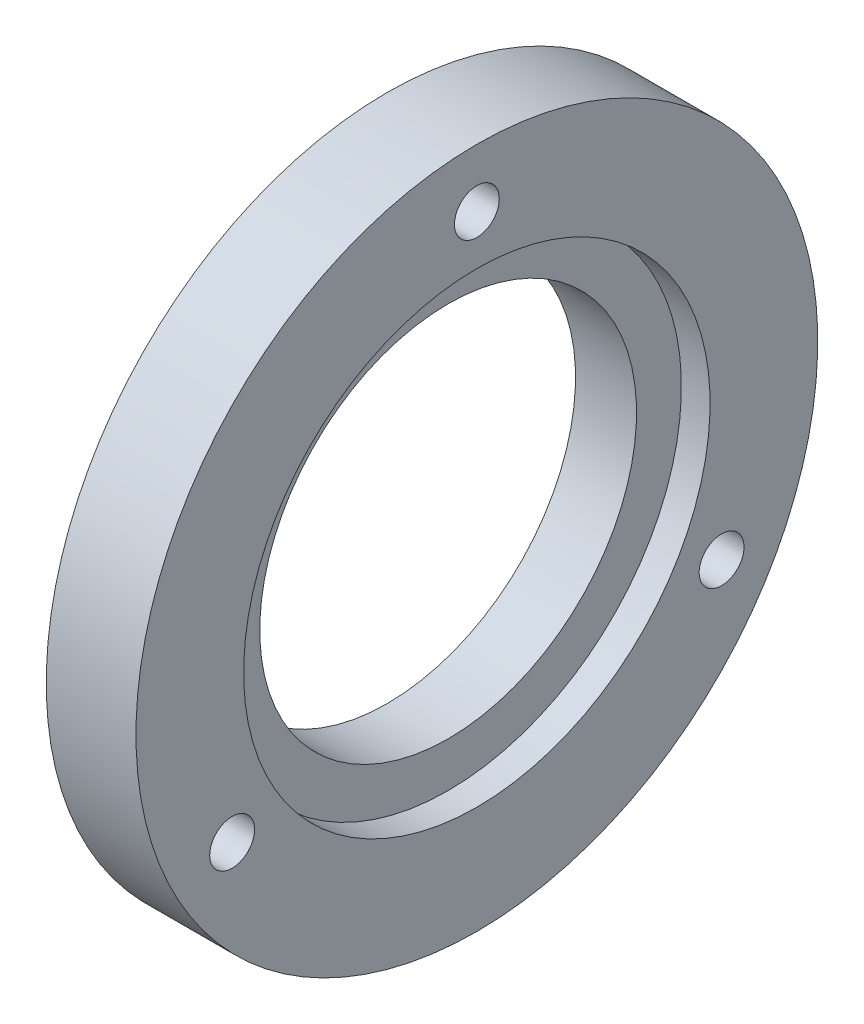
ISO-10303-21;
HEADER;
FILE_DESCRIPTION(('STEP AP214'),'2;1');
FILE_NAME('part.step','',(''),(''),'','','');
FILE_SCHEMA(('AUTOMOTIVE_DESIGN { 1 0 10303 214 1 1 1 1 }'));
ENDSEC;
DATA;
#1=APPLICATION_CONTEXT('core data for automotive mechanical design processes');
#2=APPLICATION_PROTOCOL_DEFINITION('international standard','automotive_design',2000,#1);
#3=PRODUCT_CONTEXT('',#1,'mechanical');
#4=PRODUCT('Part','Part','',(#3));
#5=PRODUCT_RELATED_PRODUCT_CATEGORY('part','',(#4));
#6=PRODUCT_DEFINITION_FORMATION('','',#4);
#7=PRODUCT_DEFINITION_CONTEXT('part definition',#1,'design');
#8=PRODUCT_DEFINITION('design','',#6,#7);
#9=PRODUCT_DEFINITION_SHAPE('','',#8);
#10=(LENGTH_UNIT() NAMED_UNIT(*) SI_UNIT(.MILLI.,.METRE.));
#11=(NAMED_UNIT(*) PLANE_ANGLE_UNIT() SI_UNIT($,.RADIAN.));
#12=(NAMED_UNIT(*) SI_UNIT($,.STERADIAN.) SOLID_ANGLE_UNIT());
#13=UNCERTAINTY_MEASURE_WITH_UNIT(LENGTH_MEASURE(1.E-05),#10,'distance_accuracy_value','');
#14=(GEOMETRIC_REPRESENTATION_CONTEXT(3) GLOBAL_UNCERTAINTY_ASSIGNED_CONTEXT((#13)) GLOBAL_UNIT_ASSIGNED_CONTEXT((#10,
#11,#12)) REPRESENTATION_CONTEXT('',''));
#15=CARTESIAN_POINT('',(0.,0.,0.));
#16=DIRECTION('',(0.,0.,1.));
#17=DIRECTION('',(1.,0.,0.));
#18=AXIS2_PLACEMENT_3D('',#15,#16,#17);
#19=CARTESIAN_POINT('',(3.39999999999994,0.,0.));
#20=DIRECTION('',(1.,0.,0.));
#21=DIRECTION('',(0.,1.,0.));
#22=AXIS2_PLACEMENT_3D('',#19,#20,#21);
#23=CYLINDRICAL_SURFACE('',#22,13.);
#24=CARTESIAN_POINT('',(5.,0.,0.));
#25=DIRECTION('',(1.,0.,0.));
#26=DIRECTION('',(0.,1.,0.));
#27=AXIS2_PLACEMENT_3D('',#24,#25,#26);
#28=CIRCLE('',#27,13.);
#29=CARTESIAN_POINT('',(5.00000000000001,13.,0.));
#30=VERTEX_POINT('',#29);
#31=EDGE_CURVE('E18',#30,#30,#28,.F.);
#32=ORIENTED_EDGE('',*,*,#31,.F.);
#33=EDGE_LOOP('',(#32));
#34=FACE_BOUND('',#33,.T.);
#35=CARTESIAN_POINT('',(3.39999999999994,0.,0.));
#36=DIRECTION('',(1.,0.,0.));
#37=DIRECTION('',(0.,1.,0.));
#38=AXIS2_PLACEMENT_3D('',#35,#36,#37);
#39=CIRCLE('',#38,13.);
#40=CARTESIAN_POINT('',(3.39999999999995,13.,0.));
#41=VERTEX_POINT('',#40);
#42=EDGE_CURVE('E52',#41,#41,#39,.T.);
#43=ORIENTED_EDGE('',*,*,#42,.F.);
#44=EDGE_LOOP('',(#43));
#45=FACE_BOUND('',#44,.T.);
#46=ADVANCED_FACE('F15',(#34,#45),#23,.F.);
#47=CARTESIAN_POINT('',(5.,0.,-1.31838984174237E-13));
#48=DIRECTION('',(1.,0.,0.));
#49=DIRECTION('',(0.,1.,0.));
#50=AXIS2_PLACEMENT_3D('',#47,#48,#49);
#51=PLANE('',#50);
#52=CARTESIAN_POINT('',(5.,0.,-1.31838984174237E-13));
#53=DIRECTION('',(-1.,0.,0.));
#54=DIRECTION('',(0.,-1.,0.));
#55=AXIS2_PLACEMENT_3D('',#52,#53,#54);
#56=CIRCLE('',#55,19.);
#57=CARTESIAN_POINT('',(5.,-19.,-1.31838984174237E-13));
#58=VERTEX_POINT('',#57);
#59=EDGE_CURVE('E41',#58,#58,#56,.T.);
#60=ORIENTED_EDGE('',*,*,#59,.F.);
#61=EDGE_LOOP('',(#60));
#62=FACE_BOUND('',#61,.T.);
#63=ORIENTED_EDGE('',*,*,#31,.T.);
#64=EDGE_LOOP('',(#63));
#65=FACE_BOUND('',#64,.T.);
#66=CARTESIAN_POINT('',(4.99999999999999,15.75,0.));
#67=DIRECTION('',(1.,0.,0.));
#68=DIRECTION('',(0.,1.,0.));
#69=AXIS2_PLACEMENT_3D('',#66,#67,#68);
#70=CIRCLE('',#69,1.24999999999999);
#71=CARTESIAN_POINT('',(4.99999999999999,17.,0.));
#72=VERTEX_POINT('',#71);
#73=EDGE_CURVE('E44',#72,#72,#70,.F.);
#74=ORIENTED_EDGE('',*,*,#73,.T.);
#75=EDGE_LOOP('',(#74));
#76=FACE_BOUND('',#75,.T.);
#77=CARTESIAN_POINT('',(4.99999999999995,-7.87499999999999,-13.6399001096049));
#78=DIRECTION('',(1.,0.,0.));
#79=DIRECTION('',(0.,1.,0.));
#80=AXIS2_PLACEMENT_3D('',#77,#78,#79);
#81=CIRCLE('',#80,1.24999999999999);
#82=CARTESIAN_POINT('',(4.99999999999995,-6.625,-13.6399001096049));
#83=VERTEX_POINT('',#82);
#84=EDGE_CURVE('E47',#83,#83,#81,.F.);
#85=ORIENTED_EDGE('',*,*,#84,.T.);
#86=EDGE_LOOP('',(#85));
#87=FACE_BOUND('',#86,.T.);
#88=CARTESIAN_POINT('',(5.00000000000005,-7.87499999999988,13.639900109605));
#89=DIRECTION('',(1.,0.,0.));
#90=DIRECTION('',(0.,1.,0.));
#91=AXIS2_PLACEMENT_3D('',#88,#89,#90);
#92=CIRCLE('',#91,1.24999999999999);
#93=CARTESIAN_POINT('',(5.00000000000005,-6.62499999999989,13.639900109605));
#94=VERTEX_POINT('',#93);
#95=EDGE_CURVE('E50',#94,#94,#92,.F.);
#96=ORIENTED_EDGE('',*,*,#95,.T.);
#97=EDGE_LOOP('',(#96));
#98=FACE_BOUND('',#97,.T.);
#99=ADVANCED_FACE('F59',(#62,#65,#76,#87,#98),#51,.T.);
#100=CARTESIAN_POINT('',(3.39999999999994,0.,0.));
#101=DIRECTION('',(1.,0.,0.));
#102=DIRECTION('',(0.,1.,0.));
#103=AXIS2_PLACEMENT_3D('',#100,#101,#102);
#104=PLANE('',#103);
#105=ORIENTED_EDGE('',*,*,#42,.T.);
#106=EDGE_LOOP('',(#105));
#107=FACE_BOUND('',#106,.T.);
#108=CARTESIAN_POINT('',(3.39999999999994,0.,-1.31874867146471E-13));
#109=DIRECTION('',(-1.,0.,0.));
#110=DIRECTION('',(0.,-1.,0.));
#111=AXIS2_PLACEMENT_3D('',#108,#109,#110);
#112=CIRCLE('',#111,10.5);
#113=CARTESIAN_POINT('',(3.39999999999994,-10.5,-1.31874867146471E-13));
#114=VERTEX_POINT('',#113);
#115=EDGE_CURVE('E38',#114,#114,#112,.T.);
#116=ORIENTED_EDGE('',*,*,#115,.T.);
#117=EDGE_LOOP('',(#116));
#118=FACE_BOUND('',#117,.T.);
#119=ADVANCED_FACE('F68',(#107,#118),#104,.T.);
#120=CARTESIAN_POINT('',(4.99999999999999,-7.87499999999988,13.639900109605));
#121=DIRECTION('',(1.,0.,0.));
#122=DIRECTION('',(0.,1.,0.));
#123=AXIS2_PLACEMENT_3D('',#120,#121,#122);
#124=CYLINDRICAL_SURFACE('',#123,1.24999999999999);
#125=CARTESIAN_POINT('',(0.,-7.87499999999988,13.639900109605));
#126=DIRECTION('',(1.,0.,0.));
#127=DIRECTION('',(0.,1.,0.));
#128=AXIS2_PLACEMENT_3D('',#125,#126,#127);
#129=CIRCLE('',#128,1.24999999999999);
#130=CARTESIAN_POINT('',(0.,-6.62499999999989,13.639900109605));
#131=VERTEX_POINT('',#130);
#132=EDGE_CURVE('E35',#131,#131,#129,.F.);
#133=ORIENTED_EDGE('',*,*,#132,.T.);
#134=EDGE_LOOP('',(#133));
#135=FACE_BOUND('',#134,.T.);
#136=ORIENTED_EDGE('',*,*,#95,.F.);
#137=EDGE_LOOP('',(#136));
#138=FACE_BOUND('',#137,.T.);
#139=ADVANCED_FACE('F92',(#135,#138),#124,.F.);
#140=CARTESIAN_POINT('',(4.99999999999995,-7.87499999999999,-13.6399001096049));
#141=DIRECTION('',(1.,0.,0.));
#142=DIRECTION('',(0.,1.,0.));
#143=AXIS2_PLACEMENT_3D('',#140,#141,#142);
#144=CYLINDRICAL_SURFACE('',#143,1.24999999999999);
#145=CARTESIAN_POINT('',(0.,-7.87499999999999,-13.6399001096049));
#146=DIRECTION('',(1.,0.,0.));
#147=DIRECTION('',(0.,1.,0.));
#148=AXIS2_PLACEMENT_3D('',#145,#146,#147);
#149=CIRCLE('',#148,1.24999999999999);
#150=CARTESIAN_POINT('',(0.,-6.625,-13.6399001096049));
#151=VERTEX_POINT('',#150);
#152=EDGE_CURVE('E32',#151,#151,#149,.F.);
#153=ORIENTED_EDGE('',*,*,#152,.T.);
#154=EDGE_LOOP('',(#153));
#155=FACE_BOUND('',#154,.T.);
#156=ORIENTED_EDGE('',*,*,#84,.F.);
#157=EDGE_LOOP('',(#156));
#158=FACE_BOUND('',#157,.T.);
#159=ADVANCED_FACE('F88',(#155,#158),#144,.F.);
#160=CARTESIAN_POINT('',(4.99999999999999,15.75,0.));
#161=DIRECTION('',(1.,0.,0.));
#162=DIRECTION('',(0.,1.,0.));
#163=AXIS2_PLACEMENT_3D('',#160,#161,#162);
#164=CYLINDRICAL_SURFACE('',#163,1.24999999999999);
#165=CARTESIAN_POINT('',(0.,15.75,0.));
#166=DIRECTION('',(1.,0.,0.));
#167=DIRECTION('',(0.,1.,0.));
#168=AXIS2_PLACEMENT_3D('',#165,#166,#167);
#169=CIRCLE('',#168,1.24999999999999);
#170=CARTESIAN_POINT('',(0.,17.,0.));
#171=VERTEX_POINT('',#170);
#172=EDGE_CURVE('E27',#171,#171,#169,.F.);
#173=ORIENTED_EDGE('',*,*,#172,.T.);
#174=EDGE_LOOP('',(#173));
#175=FACE_BOUND('',#174,.T.);
#176=ORIENTED_EDGE('',*,*,#73,.F.);
#177=EDGE_LOOP('',(#176));
#178=FACE_BOUND('',#177,.T.);
#179=ADVANCED_FACE('F84',(#175,#178),#164,.F.);
#180=CARTESIAN_POINT('',(5.,0.,-1.31838984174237E-13));
#181=DIRECTION('',(-1.,0.,0.));
#182=DIRECTION('',(0.,-1.,0.));
#183=AXIS2_PLACEMENT_3D('',#180,#181,#182);
#184=CYLINDRICAL_SURFACE('',#183,19.);
#185=ORIENTED_EDGE('',*,*,#59,.T.);
#186=EDGE_LOOP('',(#185));
#187=FACE_BOUND('',#186,.T.);
#188=CARTESIAN_POINT('',(0.,0.,-1.31951118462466E-13));
#189=DIRECTION('',(-1.,0.,0.));
#190=DIRECTION('',(0.,-1.,0.));
#191=AXIS2_PLACEMENT_3D('',#188,#189,#190);
#192=CIRCLE('',#191,19.);
#193=CARTESIAN_POINT('',(0.,-19.,-1.31951118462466E-13));
#194=VERTEX_POINT('',#193);
#195=EDGE_CURVE('E22',#194,#194,#192,.F.);
#196=ORIENTED_EDGE('',*,*,#195,.T.);
#197=EDGE_LOOP('',(#196));
#198=FACE_BOUND('',#197,.T.);
#199=ADVANCED_FACE('F78',(#187,#198),#184,.T.);
#200=CARTESIAN_POINT('',(5.,0.,-1.31838984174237E-13));
#201=DIRECTION('',(-1.,0.,0.));
#202=DIRECTION('',(0.,-1.,0.));
#203=AXIS2_PLACEMENT_3D('',#200,#201,#202);
#204=CYLINDRICAL_SURFACE('',#203,10.5);
#205=CARTESIAN_POINT('',(0.,0.,-1.31951118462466E-13));
#206=DIRECTION('',(-1.,0.,0.));
#207=DIRECTION('',(0.,-1.,0.));
#208=AXIS2_PLACEMENT_3D('',#205,#206,#207);
#209=CIRCLE('',#208,10.5);
#210=CARTESIAN_POINT('',(0.,-10.5,-1.31951118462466E-13));
#211=VERTEX_POINT('',#210);
#212=EDGE_CURVE('E10',#211,#211,#209,.T.);
#213=ORIENTED_EDGE('',*,*,#212,.T.);
#214=EDGE_LOOP('',(#213));
#215=FACE_BOUND('',#214,.T.);
#216=ORIENTED_EDGE('',*,*,#115,.F.);
#217=EDGE_LOOP('',(#216));
#218=FACE_BOUND('',#217,.T.);
#219=ADVANCED_FACE('F72',(#215,#218),#204,.F.);
#220=CARTESIAN_POINT('',(0.,0.,0.));
#221=DIRECTION('',(1.,0.,0.));
#222=DIRECTION('',(0.,1.,0.));
#223=AXIS2_PLACEMENT_3D('',#220,#221,#222);
#224=PLANE('',#223);
#225=ORIENTED_EDGE('',*,*,#212,.F.);
#226=EDGE_LOOP('',(#225));
#227=FACE_BOUND('',#226,.T.);
#228=ORIENTED_EDGE('',*,*,#195,.F.);
#229=EDGE_LOOP('',(#228));
#230=FACE_BOUND('',#229,.T.);
#231=ORIENTED_EDGE('',*,*,#172,.F.);
#232=EDGE_LOOP('',(#231));
#233=FACE_BOUND('',#232,.T.);
#234=ORIENTED_EDGE('',*,*,#152,.F.);
#235=EDGE_LOOP('',(#234));
#236=FACE_BOUND('',#235,.T.);
#237=ORIENTED_EDGE('',*,*,#132,.F.);
#238=EDGE_LOOP('',(#237));
#239=FACE_BOUND('',#238,.T.);
#240=ADVANCED_FACE('F70',(#227,#230,#233,#236,#239),#224,.F.);
#241=CLOSED_SHELL('',(#46,#99,#119,#139,#159,#179,#199,#219,#240));
#242=MANIFOLD_SOLID_BREP('B1',#241);
#243=ADVANCED_BREP_SHAPE_REPRESENTATION('',(#18,#242),#14);
#244=SHAPE_DEFINITION_REPRESENTATION(#9,#243);
ENDSEC;
END-ISO-10303-21;
